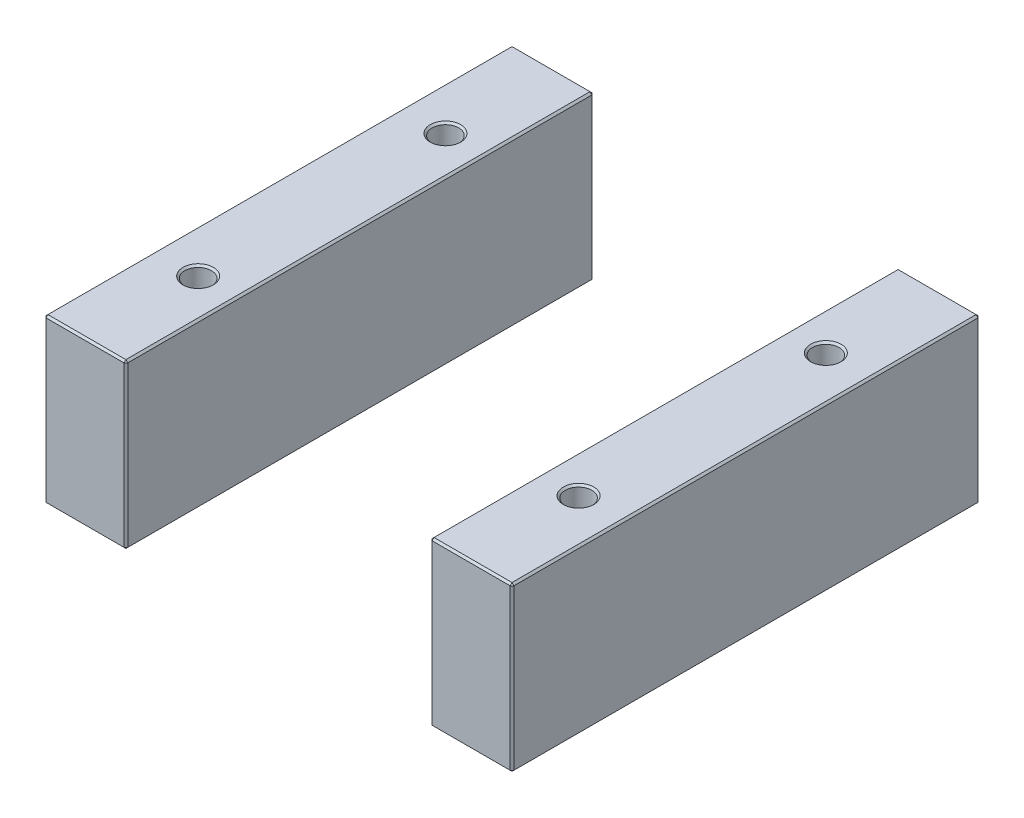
ISO-10303-21;
HEADER;
FILE_DESCRIPTION(('STEP AP214'),'2;1');
FILE_NAME('part.step','',(''),(''),'','','');
FILE_SCHEMA(('AUTOMOTIVE_DESIGN { 1 0 10303 214 1 1 1 1 }'));
ENDSEC;
DATA;
#1=APPLICATION_CONTEXT('core data for automotive mechanical design processes');
#2=APPLICATION_PROTOCOL_DEFINITION('international standard','automotive_design',2000,#1);
#3=PRODUCT_CONTEXT('',#1,'mechanical');
#4=PRODUCT('Part','Part','',(#3));
#5=PRODUCT_RELATED_PRODUCT_CATEGORY('part','',(#4));
#6=PRODUCT_DEFINITION_FORMATION('','',#4);
#7=PRODUCT_DEFINITION_CONTEXT('part definition',#1,'design');
#8=PRODUCT_DEFINITION('design','',#6,#7);
#9=PRODUCT_DEFINITION_SHAPE('','',#8);
#10=(LENGTH_UNIT() NAMED_UNIT(*) SI_UNIT(.MILLI.,.METRE.));
#11=(NAMED_UNIT(*) PLANE_ANGLE_UNIT() SI_UNIT($,.RADIAN.));
#12=(NAMED_UNIT(*) SI_UNIT($,.STERADIAN.) SOLID_ANGLE_UNIT());
#13=UNCERTAINTY_MEASURE_WITH_UNIT(LENGTH_MEASURE(1.E-05),#10,'distance_accuracy_value','');
#14=(GEOMETRIC_REPRESENTATION_CONTEXT(3) GLOBAL_UNCERTAINTY_ASSIGNED_CONTEXT((#13)) GLOBAL_UNIT_ASSIGNED_CONTEXT((#10,
#11,#12)) REPRESENTATION_CONTEXT('',''));
#15=CARTESIAN_POINT('',(0.,0.,0.));
#16=DIRECTION('',(0.,0.,1.));
#17=DIRECTION('',(1.,0.,0.));
#18=AXIS2_PLACEMENT_3D('',#15,#16,#17);
#19=CARTESIAN_POINT('',(-123.,86.,-123.));
#20=DIRECTION('',(0.,0.,1.));
#21=DIRECTION('',(1.,0.,0.));
#22=AXIS2_PLACEMENT_3D('',#19,#20,#21);
#23=PLANE('',#22);
#24=DIRECTION('',(-1.,0.,0.));
#25=VECTOR('',#24,1.);
#26=CARTESIAN_POINT('',(-123.,0.999999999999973,-123.));
#27=LINE('',#26,#25);
#28=CARTESIAN_POINT('',(-81.,0.999999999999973,-123.));
#29=VERTEX_POINT('',#28);
#30=CARTESIAN_POINT('',(-122.,0.999999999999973,-123.));
#31=VERTEX_POINT('',#30);
#32=EDGE_CURVE('P0_E137',#29,#31,#27,.T.);
#33=ORIENTED_EDGE('',*,*,#32,.T.);
#34=DIRECTION('',(0.,1.,0.));
#35=VECTOR('',#34,1.);
#36=CARTESIAN_POINT('',(-122.,86.,-123.));
#37=LINE('',#36,#35);
#38=CARTESIAN_POINT('',(-122.,85.,-123.));
#39=VERTEX_POINT('',#38);
#40=EDGE_CURVE('P0_E235',#31,#39,#37,.T.);
#41=ORIENTED_EDGE('',*,*,#40,.T.);
#42=DIRECTION('',(1.,0.,0.));
#43=VECTOR('',#42,1.);
#44=CARTESIAN_POINT('',(-123.,85.,-123.));
#45=LINE('',#44,#43);
#46=CARTESIAN_POINT('',(-81.,85.,-123.));
#47=VERTEX_POINT('',#46);
#48=EDGE_CURVE('P0_E233',#39,#47,#45,.T.);
#49=ORIENTED_EDGE('',*,*,#48,.T.);
#50=DIRECTION('',(0.,-1.,0.));
#51=VECTOR('',#50,1.);
#52=CARTESIAN_POINT('',(-81.,86.,-123.));
#53=LINE('',#52,#51);
#54=EDGE_CURVE('P0_E230',#47,#29,#53,.T.);
#55=ORIENTED_EDGE('',*,*,#54,.T.);
#56=EDGE_LOOP('',(#33,#41,#49,#55));
#57=FACE_BOUND('',#56,.T.);
#58=ADVANCED_FACE('P0_F16',(#57),#23,.F.);
#59=CARTESIAN_POINT('',(-123.,86.,123.));
#60=DIRECTION('',(1.,0.,0.));
#61=DIRECTION('',(0.,0.,-1.));
#62=AXIS2_PLACEMENT_3D('',#59,#60,#61);
#63=PLANE('',#62);
#64=DIRECTION('',(0.,1.,0.));
#65=VECTOR('',#64,1.);
#66=CARTESIAN_POINT('',(-123.,86.,122.));
#67=LINE('',#66,#65);
#68=CARTESIAN_POINT('',(-123.,0.999999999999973,122.));
#69=VERTEX_POINT('',#68);
#70=CARTESIAN_POINT('',(-123.,85.,122.));
#71=VERTEX_POINT('',#70);
#72=EDGE_CURVE('P0_E217',#69,#71,#67,.T.);
#73=ORIENTED_EDGE('',*,*,#72,.T.);
#74=DIRECTION('',(0.,0.,-1.));
#75=VECTOR('',#74,1.);
#76=CARTESIAN_POINT('',(-123.,85.,123.));
#77=LINE('',#76,#75);
#78=CARTESIAN_POINT('',(-123.,85.,-122.));
#79=VERTEX_POINT('',#78);
#80=EDGE_CURVE('P0_E228',#71,#79,#77,.T.);
#81=ORIENTED_EDGE('',*,*,#80,.T.);
#82=DIRECTION('',(0.,-1.,0.));
#83=VECTOR('',#82,1.);
#84=CARTESIAN_POINT('',(-123.,86.,-122.));
#85=LINE('',#84,#83);
#86=CARTESIAN_POINT('',(-123.,0.999999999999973,-122.));
#87=VERTEX_POINT('',#86);
#88=EDGE_CURVE('P0_E225',#79,#87,#85,.T.);
#89=ORIENTED_EDGE('',*,*,#88,.T.);
#90=DIRECTION('',(0.,0.,1.));
#91=VECTOR('',#90,1.);
#92=CARTESIAN_POINT('',(-123.,0.999999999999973,123.));
#93=LINE('',#92,#91);
#94=EDGE_CURVE('P0_E214',#87,#69,#93,.T.);
#95=ORIENTED_EDGE('',*,*,#94,.T.);
#96=EDGE_LOOP('',(#73,#81,#89,#95));
#97=FACE_BOUND('',#96,.T.);
#98=ADVANCED_FACE('P0_F302',(#97),#63,.F.);
#99=CARTESIAN_POINT('',(-123.,86.,123.));
#100=DIRECTION('',(0.,0.,-1.));
#101=DIRECTION('',(-1.,0.,0.));
#102=AXIS2_PLACEMENT_3D('',#99,#100,#101);
#103=PLANE('',#102);
#104=DIRECTION('',(-1.,0.,0.));
#105=VECTOR('',#104,1.);
#106=CARTESIAN_POINT('',(-123.,85.,123.));
#107=LINE('',#106,#105);
#108=CARTESIAN_POINT('',(-81.,85.,123.));
#109=VERTEX_POINT('',#108);
#110=CARTESIAN_POINT('',(-122.,85.,123.));
#111=VERTEX_POINT('',#110);
#112=EDGE_CURVE('P0_E242',#109,#111,#107,.T.);
#113=ORIENTED_EDGE('',*,*,#112,.T.);
#114=DIRECTION('',(0.,-1.,0.));
#115=VECTOR('',#114,1.);
#116=CARTESIAN_POINT('',(-122.,86.,123.));
#117=LINE('',#116,#115);
#118=CARTESIAN_POINT('',(-122.,0.999999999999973,123.));
#119=VERTEX_POINT('',#118);
#120=EDGE_CURVE('P0_E244',#111,#119,#117,.T.);
#121=ORIENTED_EDGE('',*,*,#120,.T.);
#122=DIRECTION('',(1.,0.,0.));
#123=VECTOR('',#122,1.);
#124=CARTESIAN_POINT('',(-80.,0.999999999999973,123.));
#125=LINE('',#124,#123);
#126=CARTESIAN_POINT('',(-81.,0.999999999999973,123.));
#127=VERTEX_POINT('',#126);
#128=EDGE_CURVE('P0_E240',#119,#127,#125,.T.);
#129=ORIENTED_EDGE('',*,*,#128,.T.);
#130=DIRECTION('',(0.,1.,0.));
#131=VECTOR('',#130,1.);
#132=CARTESIAN_POINT('',(-81.,86.,123.));
#133=LINE('',#132,#131);
#134=EDGE_CURVE('P0_E238',#127,#109,#133,.T.);
#135=ORIENTED_EDGE('',*,*,#134,.T.);
#136=EDGE_LOOP('',(#113,#121,#129,#135));
#137=FACE_BOUND('',#136,.T.);
#138=ADVANCED_FACE('P0_F341',(#137),#103,.F.);
#139=CARTESIAN_POINT('',(-80.,86.,-123.));
#140=DIRECTION('',(-1.,0.,0.));
#141=DIRECTION('',(0.,0.,1.));
#142=AXIS2_PLACEMENT_3D('',#139,#140,#141);
#143=PLANE('',#142);
#144=DIRECTION('',(0.,0.,1.));
#145=VECTOR('',#144,1.);
#146=CARTESIAN_POINT('',(-80.,85.,-123.));
#147=LINE('',#146,#145);
#148=CARTESIAN_POINT('',(-80.,85.,-122.));
#149=VERTEX_POINT('',#148);
#150=CARTESIAN_POINT('',(-80.,85.,122.));
#151=VERTEX_POINT('',#150);
#152=EDGE_CURVE('P0_E31',#149,#151,#147,.T.);
#153=ORIENTED_EDGE('',*,*,#152,.T.);
#154=DIRECTION('',(0.,-1.,0.));
#155=VECTOR('',#154,1.);
#156=CARTESIAN_POINT('',(-80.,86.,122.));
#157=LINE('',#156,#155);
#158=CARTESIAN_POINT('',(-80.,0.999999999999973,122.));
#159=VERTEX_POINT('',#158);
#160=EDGE_CURVE('P0_E190',#151,#159,#157,.T.);
#161=ORIENTED_EDGE('',*,*,#160,.T.);
#162=DIRECTION('',(0.,0.,-1.));
#163=VECTOR('',#162,1.);
#164=CARTESIAN_POINT('',(-80.,0.999999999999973,-123.));
#165=LINE('',#164,#163);
#166=CARTESIAN_POINT('',(-80.,0.999999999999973,-122.));
#167=VERTEX_POINT('',#166);
#168=EDGE_CURVE('P0_E256',#159,#167,#165,.T.);
#169=ORIENTED_EDGE('',*,*,#168,.T.);
#170=DIRECTION('',(0.,1.,0.));
#171=VECTOR('',#170,1.);
#172=CARTESIAN_POINT('',(-80.,86.,-122.));
#173=LINE('',#172,#171);
#174=EDGE_CURVE('P0_E36',#167,#149,#173,.T.);
#175=ORIENTED_EDGE('',*,*,#174,.T.);
#176=EDGE_LOOP('',(#153,#161,#169,#175));
#177=FACE_BOUND('',#176,.T.);
#178=ADVANCED_FACE('P0_F535',(#177),#143,.F.);
#179=CARTESIAN_POINT('',(0.,86.,0.));
#180=DIRECTION('',(0.,-1.,0.));
#181=DIRECTION('',(0.,0.,-1.));
#182=AXIS2_PLACEMENT_3D('',#179,#180,#181);
#183=PLANE('',#182);
#184=CARTESIAN_POINT('',(-100.,86.,65.));
#185=DIRECTION('',(0.,-1.,0.));
#186=DIRECTION('',(0.,0.,-1.));
#187=AXIS2_PLACEMENT_3D('',#184,#185,#186);
#188=CIRCLE('',#187,8.);
#189=CARTESIAN_POINT('',(-100.,86.,57.));
#190=VERTEX_POINT('',#189);
#191=EDGE_CURVE('P0_E24',#190,#190,#188,.T.);
#192=ORIENTED_EDGE('',*,*,#191,.T.);
#193=EDGE_LOOP('',(#192));
#194=FACE_BOUND('',#193,.T.);
#195=CARTESIAN_POINT('',(-100.,86.,-65.));
#196=DIRECTION('',(0.,-1.,0.));
#197=DIRECTION('',(0.,0.,-1.));
#198=AXIS2_PLACEMENT_3D('',#195,#196,#197);
#199=CIRCLE('',#198,8.);
#200=CARTESIAN_POINT('',(-100.,86.,-73.));
#201=VERTEX_POINT('',#200);
#202=EDGE_CURVE('P0_E189',#201,#201,#199,.T.);
#203=ORIENTED_EDGE('',*,*,#202,.T.);
#204=EDGE_LOOP('',(#203));
#205=FACE_BOUND('',#204,.T.);
#206=DIRECTION('',(0.,0.,1.));
#207=VECTOR('',#206,1.);
#208=CARTESIAN_POINT('',(-122.,86.,0.));
#209=LINE('',#208,#207);
#210=CARTESIAN_POINT('',(-122.,86.,-122.));
#211=VERTEX_POINT('',#210);
#212=CARTESIAN_POINT('',(-122.,86.,122.));
#213=VERTEX_POINT('',#212);
#214=EDGE_CURVE('P0_E251',#211,#213,#209,.T.);
#215=ORIENTED_EDGE('',*,*,#214,.T.);
#216=DIRECTION('',(1.,0.,0.));
#217=VECTOR('',#216,1.);
#218=CARTESIAN_POINT('',(0.,86.,122.));
#219=LINE('',#218,#217);
#220=CARTESIAN_POINT('',(-81.,86.,122.));
#221=VERTEX_POINT('',#220);
#222=EDGE_CURVE('P0_E253',#213,#221,#219,.T.);
#223=ORIENTED_EDGE('',*,*,#222,.T.);
#224=DIRECTION('',(0.,0.,-1.));
#225=VECTOR('',#224,1.);
#226=CARTESIAN_POINT('',(-81.,86.,0.));
#227=LINE('',#226,#225);
#228=CARTESIAN_POINT('',(-81.,86.,-122.));
#229=VERTEX_POINT('',#228);
#230=EDGE_CURVE('P0_E247',#221,#229,#227,.T.);
#231=ORIENTED_EDGE('',*,*,#230,.T.);
#232=DIRECTION('',(-1.,0.,0.));
#233=VECTOR('',#232,1.);
#234=CARTESIAN_POINT('',(0.,86.,-122.));
#235=LINE('',#234,#233);
#236=EDGE_CURVE('P0_E249',#229,#211,#235,.T.);
#237=ORIENTED_EDGE('',*,*,#236,.T.);
#238=EDGE_LOOP('',(#215,#223,#231,#237));
#239=FACE_BOUND('',#238,.T.);
#240=ADVANCED_FACE('P0_F195',(#194,#205,#239),#183,.F.);
#241=CARTESIAN_POINT('',(0.,0.,0.));
#242=DIRECTION('',(0.,-1.,0.));
#243=DIRECTION('',(0.,0.,-1.));
#244=AXIS2_PLACEMENT_3D('',#241,#242,#243);
#245=PLANE('',#244);
#246=CARTESIAN_POINT('',(-100.,0.,-65.));
#247=DIRECTION('',(0.,-1.,0.));
#248=DIRECTION('',(0.,0.,-1.));
#249=AXIS2_PLACEMENT_3D('',#246,#247,#248);
#250=CIRCLE('',#249,8.);
#251=CARTESIAN_POINT('',(-100.,0.,-73.));
#252=VERTEX_POINT('',#251);
#253=EDGE_CURVE('P0_E220',#252,#252,#250,.F.);
#254=ORIENTED_EDGE('',*,*,#253,.T.);
#255=EDGE_LOOP('',(#254));
#256=FACE_BOUND('',#255,.T.);
#257=CARTESIAN_POINT('',(-100.,0.,65.));
#258=DIRECTION('',(0.,-1.,0.));
#259=DIRECTION('',(0.,0.,-1.));
#260=AXIS2_PLACEMENT_3D('',#257,#258,#259);
#261=CIRCLE('',#260,8.);
#262=CARTESIAN_POINT('',(-100.,0.,57.));
#263=VERTEX_POINT('',#262);
#264=EDGE_CURVE('P0_E608',#263,#263,#261,.F.);
#265=ORIENTED_EDGE('',*,*,#264,.T.);
#266=EDGE_LOOP('',(#265));
#267=FACE_BOUND('',#266,.T.);
#268=DIRECTION('',(-1.,0.,0.));
#269=VECTOR('',#268,1.);
#270=CARTESIAN_POINT('',(-123.,0.,122.));
#271=LINE('',#270,#269);
#272=CARTESIAN_POINT('',(-81.,0.,122.));
#273=VERTEX_POINT('',#272);
#274=CARTESIAN_POINT('',(-122.,0.,122.));
#275=VERTEX_POINT('',#274);
#276=EDGE_CURVE('P0_E114',#273,#275,#271,.T.);
#277=ORIENTED_EDGE('',*,*,#276,.T.);
#278=DIRECTION('',(0.,0.,-1.));
#279=VECTOR('',#278,1.);
#280=CARTESIAN_POINT('',(-122.,0.,-123.));
#281=LINE('',#280,#279);
#282=CARTESIAN_POINT('',(-122.,0.,-122.));
#283=VERTEX_POINT('',#282);
#284=EDGE_CURVE('P0_E110',#275,#283,#281,.T.);
#285=ORIENTED_EDGE('',*,*,#284,.T.);
#286=DIRECTION('',(1.,0.,0.));
#287=VECTOR('',#286,1.);
#288=CARTESIAN_POINT('',(-80.,0.,-122.));
#289=LINE('',#288,#287);
#290=CARTESIAN_POINT('',(-81.,0.,-122.));
#291=VERTEX_POINT('',#290);
#292=EDGE_CURVE('P0_E104',#283,#291,#289,.T.);
#293=ORIENTED_EDGE('',*,*,#292,.T.);
#294=DIRECTION('',(0.,0.,1.));
#295=VECTOR('',#294,1.);
#296=CARTESIAN_POINT('',(-81.,0.,123.));
#297=LINE('',#296,#295);
#298=EDGE_CURVE('P0_E107',#291,#273,#297,.T.);
#299=ORIENTED_EDGE('',*,*,#298,.T.);
#300=EDGE_LOOP('',(#277,#285,#293,#299));
#301=FACE_BOUND('',#300,.T.);
#302=ADVANCED_FACE('P0_F106',(#256,#267,#301),#245,.T.);
#303=CARTESIAN_POINT('',(-100.,0.,-65.));
#304=DIRECTION('',(0.,1.,0.));
#305=DIRECTION('',(0.,0.,1.));
#306=AXIS2_PLACEMENT_3D('',#303,#304,#305);
#307=CYLINDRICAL_SURFACE('',#306,7.);
#308=CARTESIAN_POINT('',(-100.,85.,-65.));
#309=DIRECTION('',(0.,-1.,0.));
#310=DIRECTION('',(0.,0.,-1.));
#311=AXIS2_PLACEMENT_3D('',#308,#309,#310);
#312=CIRCLE('',#311,7.);
#313=CARTESIAN_POINT('',(-100.,85.,-72.));
#314=VERTEX_POINT('',#313);
#315=EDGE_CURVE('P0_E10',#314,#314,#312,.F.);
#316=ORIENTED_EDGE('',*,*,#315,.T.);
#317=EDGE_LOOP('',(#316));
#318=FACE_BOUND('',#317,.T.);
#319=CARTESIAN_POINT('',(-100.,0.999999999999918,-65.));
#320=DIRECTION('',(0.,-1.,0.));
#321=DIRECTION('',(0.,0.,-1.));
#322=AXIS2_PLACEMENT_3D('',#319,#320,#321);
#323=CIRCLE('',#322,7.);
#324=CARTESIAN_POINT('',(-100.,0.999999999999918,-72.));
#325=VERTEX_POINT('',#324);
#326=EDGE_CURVE('P0_E215',#325,#325,#323,.T.);
#327=ORIENTED_EDGE('',*,*,#326,.T.);
#328=EDGE_LOOP('',(#327));
#329=FACE_BOUND('',#328,.T.);
#330=ADVANCED_FACE('P0_F208',(#318,#329),#307,.F.);
#331=CARTESIAN_POINT('',(-100.,0.,65.));
#332=DIRECTION('',(0.,1.,0.));
#333=DIRECTION('',(0.,0.,1.));
#334=AXIS2_PLACEMENT_3D('',#331,#332,#333);
#335=CYLINDRICAL_SURFACE('',#334,7.);
#336=CARTESIAN_POINT('',(-100.,85.,65.));
#337=DIRECTION('',(0.,-1.,0.));
#338=DIRECTION('',(0.,0.,-1.));
#339=AXIS2_PLACEMENT_3D('',#336,#337,#338);
#340=CIRCLE('',#339,7.);
#341=CARTESIAN_POINT('',(-100.,85.,58.));
#342=VERTEX_POINT('',#341);
#343=EDGE_CURVE('P0_E186',#342,#342,#340,.F.);
#344=ORIENTED_EDGE('',*,*,#343,.T.);
#345=EDGE_LOOP('',(#344));
#346=FACE_BOUND('',#345,.T.);
#347=CARTESIAN_POINT('',(-100.,0.99999999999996,65.));
#348=DIRECTION('',(0.,-1.,0.));
#349=DIRECTION('',(0.,0.,-1.));
#350=AXIS2_PLACEMENT_3D('',#347,#348,#349);
#351=CIRCLE('',#350,7.);
#352=CARTESIAN_POINT('',(-100.,0.99999999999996,58.));
#353=VERTEX_POINT('',#352);
#354=EDGE_CURVE('P0_E212',#353,#353,#351,.T.);
#355=ORIENTED_EDGE('',*,*,#354,.T.);
#356=EDGE_LOOP('',(#355));
#357=FACE_BOUND('',#356,.T.);
#358=ADVANCED_FACE('P0_F204',(#346,#357),#335,.F.);
#359=CARTESIAN_POINT('',(-100.,0.,-65.));
#360=DIRECTION('',(0.,-1.,0.));
#361=DIRECTION('',(0.,0.,-1.));
#362=AXIS2_PLACEMENT_3D('',#359,#360,#361);
#363=CONICAL_SURFACE('',#362,8.,0.785398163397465);
#364=ORIENTED_EDGE('',*,*,#326,.F.);
#365=EDGE_LOOP('',(#364));
#366=FACE_BOUND('',#365,.T.);
#367=ORIENTED_EDGE('',*,*,#253,.F.);
#368=EDGE_LOOP('',(#367));
#369=FACE_BOUND('',#368,.T.);
#370=ADVANCED_FACE('P0_F207',(#366,#369),#363,.F.);
#371=CARTESIAN_POINT('',(-100.,0.,65.));
#372=DIRECTION('',(0.,-1.,0.));
#373=DIRECTION('',(0.,0.,-1.));
#374=AXIS2_PLACEMENT_3D('',#371,#372,#373);
#375=CONICAL_SURFACE('',#374,8.,0.785398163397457);
#376=ORIENTED_EDGE('',*,*,#354,.F.);
#377=EDGE_LOOP('',(#376));
#378=FACE_BOUND('',#377,.T.);
#379=ORIENTED_EDGE('',*,*,#264,.F.);
#380=EDGE_LOOP('',(#379));
#381=FACE_BOUND('',#380,.T.);
#382=ADVANCED_FACE('P0_F347',(#378,#381),#375,.F.);
#383=CARTESIAN_POINT('',(-80.,86.,122.));
#384=DIRECTION('',(-0.707106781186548,0.,-0.707106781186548));
#385=DIRECTION('',(0.,-1.,0.));
#386=AXIS2_PLACEMENT_3D('',#383,#384,#385);
#387=PLANE('',#386);
#388=DIRECTION('',(-0.707106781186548,0.,0.707106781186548));
#389=VECTOR('',#388,1.);
#390=CARTESIAN_POINT('',(-80.5,85.,122.5));
#391=LINE('',#390,#389);
#392=EDGE_CURVE('P0_E125',#109,#151,#391,.F.);
#393=ORIENTED_EDGE('',*,*,#392,.F.);
#394=ORIENTED_EDGE('',*,*,#134,.F.);
#395=DIRECTION('',(0.707106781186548,0.,-0.707106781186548));
#396=VECTOR('',#395,1.);
#397=CARTESIAN_POINT('',(-81.,0.999999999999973,123.));
#398=LINE('',#397,#396);
#399=EDGE_CURVE('P0_E181',#159,#127,#398,.F.);
#400=ORIENTED_EDGE('',*,*,#399,.F.);
#401=ORIENTED_EDGE('',*,*,#160,.F.);
#402=EDGE_LOOP('',(#393,#394,#400,#401));
#403=FACE_BOUND('',#402,.T.);
#404=ADVANCED_FACE('P0_F351',(#403),#387,.F.);
#405=CARTESIAN_POINT('',(-81.,86.,122.));
#406=DIRECTION('',(0.57735026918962,0.577350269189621,0.577350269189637));
#407=DIRECTION('',(0.,-0.707106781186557,0.707106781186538));
#408=AXIS2_PLACEMENT_3D('',#405,#406,#407);
#409=PLANE('',#408);
#410=DIRECTION('',(0.,0.707106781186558,-0.707106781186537));
#411=VECTOR('',#410,1.);
#412=CARTESIAN_POINT('',(-81.,86.,122.));
#413=LINE('',#412,#411);
#414=EDGE_CURVE('P0_E175',#109,#221,#413,.T.);
#415=ORIENTED_EDGE('',*,*,#414,.F.);
#416=ORIENTED_EDGE('',*,*,#392,.T.);
#417=DIRECTION('',(0.70710678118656,-0.707106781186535,0.));
#418=VECTOR('',#417,1.);
#419=CARTESIAN_POINT('',(-81.,86.,122.));
#420=LINE('',#419,#418);
#421=EDGE_CURVE('P0_E178',#221,#151,#420,.T.);
#422=ORIENTED_EDGE('',*,*,#421,.F.);
#423=EDGE_LOOP('',(#415,#416,#422));
#424=FACE_BOUND('',#423,.T.);
#425=ADVANCED_FACE('P0_F487',(#424),#409,.T.);
#426=CARTESIAN_POINT('',(-81.,0.999999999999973,123.));
#427=DIRECTION('',(0.577350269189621,-0.577350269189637,0.577350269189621));
#428=DIRECTION('',(0.,-0.707106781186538,-0.707106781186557));
#429=AXIS2_PLACEMENT_3D('',#426,#427,#428);
#430=PLANE('',#429);
#431=DIRECTION('',(0.70710678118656,0.707106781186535,0.));
#432=VECTOR('',#431,1.);
#433=CARTESIAN_POINT('',(-80.5,0.499999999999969,122.));
#434=LINE('',#433,#432);
#435=EDGE_CURVE('P0_E123',#159,#273,#434,.F.);
#436=ORIENTED_EDGE('',*,*,#435,.F.);
#437=ORIENTED_EDGE('',*,*,#399,.T.);
#438=DIRECTION('',(0.,-0.707106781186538,-0.707106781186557));
#439=VECTOR('',#438,1.);
#440=CARTESIAN_POINT('',(-81.,0.999999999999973,123.));
#441=LINE('',#440,#439);
#442=EDGE_CURVE('P0_E172',#273,#127,#441,.F.);
#443=ORIENTED_EDGE('',*,*,#442,.F.);
#444=EDGE_LOOP('',(#436,#437,#443));
#445=FACE_BOUND('',#444,.T.);
#446=ADVANCED_FACE('P0_F478',(#445),#430,.T.);
#447=CARTESIAN_POINT('',(-81.,86.,0.));
#448=DIRECTION('',(-0.707106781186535,-0.70710678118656,0.));
#449=DIRECTION('',(0.,0.,-1.));
#450=AXIS2_PLACEMENT_3D('',#447,#448,#449);
#451=PLANE('',#450);
#452=ORIENTED_EDGE('',*,*,#421,.T.);
#453=ORIENTED_EDGE('',*,*,#152,.F.);
#454=DIRECTION('',(-0.70710678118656,0.707106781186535,0.));
#455=VECTOR('',#454,1.);
#456=CARTESIAN_POINT('',(-80.5,85.5,-122.));
#457=LINE('',#456,#455);
#458=EDGE_CURVE('P0_E165',#229,#149,#457,.F.);
#459=ORIENTED_EDGE('',*,*,#458,.F.);
#460=ORIENTED_EDGE('',*,*,#230,.F.);
#461=EDGE_LOOP('',(#452,#453,#459,#460));
#462=FACE_BOUND('',#461,.T.);
#463=ADVANCED_FACE('P0_F318',(#462),#451,.F.);
#464=CARTESIAN_POINT('',(0.,86.,122.));
#465=DIRECTION('',(0.,-0.707106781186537,-0.707106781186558));
#466=DIRECTION('',(1.,0.,0.));
#467=AXIS2_PLACEMENT_3D('',#464,#465,#466);
#468=PLANE('',#467);
#469=ORIENTED_EDGE('',*,*,#414,.T.);
#470=ORIENTED_EDGE('',*,*,#222,.F.);
#471=DIRECTION('',(0.,-0.707106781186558,0.707106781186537));
#472=VECTOR('',#471,1.);
#473=CARTESIAN_POINT('',(-122.,85.5,122.5));
#474=LINE('',#473,#472);
#475=EDGE_CURVE('P0_E162',#111,#213,#474,.F.);
#476=ORIENTED_EDGE('',*,*,#475,.F.);
#477=ORIENTED_EDGE('',*,*,#112,.F.);
#478=EDGE_LOOP('',(#469,#470,#476,#477));
#479=FACE_BOUND('',#478,.T.);
#480=ADVANCED_FACE('P0_F313',(#479),#468,.F.);
#481=CARTESIAN_POINT('',(-122.,86.,123.));
#482=DIRECTION('',(0.707106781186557,0.,-0.707106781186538));
#483=DIRECTION('',(0.,-1.,0.));
#484=AXIS2_PLACEMENT_3D('',#481,#482,#483);
#485=PLANE('',#484);
#486=DIRECTION('',(0.707106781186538,0.,0.707106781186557));
#487=VECTOR('',#486,1.);
#488=CARTESIAN_POINT('',(-122.,0.999999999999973,123.));
#489=LINE('',#488,#487);
#490=EDGE_CURVE('P0_E156',#119,#69,#489,.F.);
#491=ORIENTED_EDGE('',*,*,#490,.F.);
#492=ORIENTED_EDGE('',*,*,#120,.F.);
#493=DIRECTION('',(-0.707106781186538,0.,-0.707106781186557));
#494=VECTOR('',#493,1.);
#495=CARTESIAN_POINT('',(-123.,85.,122.));
#496=LINE('',#495,#494);
#497=EDGE_CURVE('P0_E159',#71,#111,#496,.F.);
#498=ORIENTED_EDGE('',*,*,#497,.F.);
#499=ORIENTED_EDGE('',*,*,#72,.F.);
#500=EDGE_LOOP('',(#491,#492,#498,#499));
#501=FACE_BOUND('',#500,.T.);
#502=ADVANCED_FACE('P0_F307',(#501),#485,.F.);
#503=CARTESIAN_POINT('',(-123.,0.999999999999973,123.));
#504=DIRECTION('',(0.,-0.707106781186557,0.707106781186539));
#505=DIRECTION('',(-1.,0.,0.));
#506=AXIS2_PLACEMENT_3D('',#503,#504,#505);
#507=PLANE('',#506);
#508=ORIENTED_EDGE('',*,*,#442,.T.);
#509=ORIENTED_EDGE('',*,*,#128,.F.);
#510=DIRECTION('',(0.,0.707106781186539,0.707106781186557));
#511=VECTOR('',#510,1.);
#512=CARTESIAN_POINT('',(-122.,0.999999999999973,123.));
#513=LINE('',#512,#511);
#514=EDGE_CURVE('P0_E134',#275,#119,#513,.T.);
#515=ORIENTED_EDGE('',*,*,#514,.F.);
#516=ORIENTED_EDGE('',*,*,#276,.F.);
#517=EDGE_LOOP('',(#508,#509,#515,#516));
#518=FACE_BOUND('',#517,.T.);
#519=ADVANCED_FACE('P0_F333',(#518),#507,.T.);
#520=CARTESIAN_POINT('',(-80.,0.999999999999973,-123.));
#521=DIRECTION('',(0.707106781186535,-0.70710678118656,0.));
#522=DIRECTION('',(0.,0.,1.));
#523=AXIS2_PLACEMENT_3D('',#520,#521,#522);
#524=PLANE('',#523);
#525=ORIENTED_EDGE('',*,*,#435,.T.);
#526=ORIENTED_EDGE('',*,*,#298,.F.);
#527=DIRECTION('',(-0.70710678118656,-0.707106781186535,0.));
#528=VECTOR('',#527,1.);
#529=CARTESIAN_POINT('',(-81.,0.,-122.));
#530=LINE('',#529,#528);
#531=EDGE_CURVE('P0_E120',#167,#291,#530,.T.);
#532=ORIENTED_EDGE('',*,*,#531,.F.);
#533=ORIENTED_EDGE('',*,*,#168,.F.);
#534=EDGE_LOOP('',(#525,#526,#532,#533));
#535=FACE_BOUND('',#534,.T.);
#536=ADVANCED_FACE('P0_F119',(#535),#524,.T.);
#537=CARTESIAN_POINT('',(-81.,86.,-123.));
#538=DIRECTION('',(-0.707106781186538,0.,0.707106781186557));
#539=DIRECTION('',(0.,-1.,0.));
#540=AXIS2_PLACEMENT_3D('',#537,#538,#539);
#541=PLANE('',#540);
#542=DIRECTION('',(0.707106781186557,0.,0.707106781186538));
#543=VECTOR('',#542,1.);
#544=CARTESIAN_POINT('',(-81.,85.,-123.));
#545=LINE('',#544,#543);
#546=EDGE_CURVE('P0_E168',#149,#47,#545,.F.);
#547=ORIENTED_EDGE('',*,*,#546,.F.);
#548=ORIENTED_EDGE('',*,*,#174,.F.);
#549=DIRECTION('',(-0.707106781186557,0.,-0.707106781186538));
#550=VECTOR('',#549,1.);
#551=CARTESIAN_POINT('',(-80.5,0.999999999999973,-122.5));
#552=LINE('',#551,#550);
#553=EDGE_CURVE('P0_E133',#29,#167,#552,.F.);
#554=ORIENTED_EDGE('',*,*,#553,.F.);
#555=ORIENTED_EDGE('',*,*,#54,.F.);
#556=EDGE_LOOP('',(#547,#548,#554,#555));
#557=FACE_BOUND('',#556,.T.);
#558=ADVANCED_FACE('P0_F323',(#557),#541,.F.);
#559=CARTESIAN_POINT('',(-81.,85.,-123.));
#560=DIRECTION('',(0.57735026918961,0.577350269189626,-0.577350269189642));
#561=DIRECTION('',(0.,0.707106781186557,0.707106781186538));
#562=AXIS2_PLACEMENT_3D('',#559,#560,#561);
#563=PLANE('',#562);
#564=ORIENTED_EDGE('',*,*,#458,.T.);
#565=ORIENTED_EDGE('',*,*,#546,.T.);
#566=DIRECTION('',(0.,-0.707106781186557,-0.707106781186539));
#567=VECTOR('',#566,1.);
#568=CARTESIAN_POINT('',(-81.,85.,-123.));
#569=LINE('',#568,#567);
#570=EDGE_CURVE('P0_E151',#229,#47,#569,.T.);
#571=ORIENTED_EDGE('',*,*,#570,.F.);
#572=EDGE_LOOP('',(#564,#565,#571));
#573=FACE_BOUND('',#572,.T.);
#574=ADVANCED_FACE('P0_F321',(#573),#563,.T.);
#575=CARTESIAN_POINT('',(-123.,85.,122.));
#576=DIRECTION('',(-0.577350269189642,0.57735026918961,0.577350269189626));
#577=DIRECTION('',(0.707106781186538,0.,0.707106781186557));
#578=AXIS2_PLACEMENT_3D('',#575,#576,#577);
#579=PLANE('',#578);
#580=ORIENTED_EDGE('',*,*,#497,.T.);
#581=ORIENTED_EDGE('',*,*,#475,.T.);
#582=DIRECTION('',(0.707106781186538,0.707106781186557,0.));
#583=VECTOR('',#582,1.);
#584=CARTESIAN_POINT('',(-123.,85.,122.));
#585=LINE('',#584,#583);
#586=EDGE_CURVE('P0_E142',#71,#213,#585,.T.);
#587=ORIENTED_EDGE('',*,*,#586,.F.);
#588=EDGE_LOOP('',(#580,#581,#587));
#589=FACE_BOUND('',#588,.T.);
#590=ADVANCED_FACE('P0_F310',(#589),#579,.T.);
#591=CARTESIAN_POINT('',(-122.,0.999999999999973,123.));
#592=DIRECTION('',(-0.577350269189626,-0.577350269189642,0.57735026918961));
#593=DIRECTION('',(0.707106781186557,-0.707106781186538,0.));
#594=AXIS2_PLACEMENT_3D('',#591,#592,#593);
#595=PLANE('',#594);
#596=ORIENTED_EDGE('',*,*,#514,.T.);
#597=ORIENTED_EDGE('',*,*,#490,.T.);
#598=DIRECTION('',(0.707106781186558,-0.707106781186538,0.));
#599=VECTOR('',#598,1.);
#600=CARTESIAN_POINT('',(-122.5,0.499999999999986,122.));
#601=LINE('',#600,#599);
#602=EDGE_CURVE('P0_E138',#275,#69,#601,.F.);
#603=ORIENTED_EDGE('',*,*,#602,.F.);
#604=EDGE_LOOP('',(#596,#597,#603));
#605=FACE_BOUND('',#604,.T.);
#606=ADVANCED_FACE('P0_F368',(#605),#595,.T.);
#607=CARTESIAN_POINT('',(-81.,0.,-122.));
#608=DIRECTION('',(0.57735026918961,-0.577350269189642,-0.577350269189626));
#609=DIRECTION('',(0.,0.707106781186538,-0.707106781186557));
#610=AXIS2_PLACEMENT_3D('',#607,#608,#609);
#611=PLANE('',#610);
#612=ORIENTED_EDGE('',*,*,#553,.T.);
#613=ORIENTED_EDGE('',*,*,#531,.T.);
#614=DIRECTION('',(0.,0.707106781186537,-0.707106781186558));
#615=VECTOR('',#614,1.);
#616=CARTESIAN_POINT('',(-81.,0.,-122.));
#617=LINE('',#616,#615);
#618=EDGE_CURVE('P0_E130',#29,#291,#617,.F.);
#619=ORIENTED_EDGE('',*,*,#618,.F.);
#620=EDGE_LOOP('',(#612,#613,#619));
#621=FACE_BOUND('',#620,.T.);
#622=ADVANCED_FACE('P0_F129',(#621),#611,.T.);
#623=CARTESIAN_POINT('',(0.,86.,-122.));
#624=DIRECTION('',(0.,-0.707106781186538,0.707106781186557));
#625=DIRECTION('',(-1.,0.,0.));
#626=AXIS2_PLACEMENT_3D('',#623,#624,#625);
#627=PLANE('',#626);
#628=ORIENTED_EDGE('',*,*,#570,.T.);
#629=ORIENTED_EDGE('',*,*,#48,.F.);
#630=DIRECTION('',(0.,0.707106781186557,0.707106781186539));
#631=VECTOR('',#630,1.);
#632=CARTESIAN_POINT('',(-122.,85.,-123.));
#633=LINE('',#632,#631);
#634=EDGE_CURVE('P0_E139',#211,#39,#633,.F.);
#635=ORIENTED_EDGE('',*,*,#634,.F.);
#636=ORIENTED_EDGE('',*,*,#236,.F.);
#637=EDGE_LOOP('',(#628,#629,#635,#636));
#638=FACE_BOUND('',#637,.T.);
#639=ADVANCED_FACE('P0_F286',(#638),#627,.F.);
#640=CARTESIAN_POINT('',(-122.,86.,0.));
#641=DIRECTION('',(0.707106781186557,-0.707106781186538,0.));
#642=DIRECTION('',(0.,0.,1.));
#643=AXIS2_PLACEMENT_3D('',#640,#641,#642);
#644=PLANE('',#643);
#645=ORIENTED_EDGE('',*,*,#586,.T.);
#646=ORIENTED_EDGE('',*,*,#214,.F.);
#647=DIRECTION('',(-0.707106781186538,-0.707106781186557,0.));
#648=VECTOR('',#647,1.);
#649=CARTESIAN_POINT('',(-122.5,85.5,-122.));
#650=LINE('',#649,#648);
#651=EDGE_CURVE('P0_E145',#79,#211,#650,.F.);
#652=ORIENTED_EDGE('',*,*,#651,.F.);
#653=ORIENTED_EDGE('',*,*,#80,.F.);
#654=EDGE_LOOP('',(#645,#646,#652,#653));
#655=FACE_BOUND('',#654,.T.);
#656=ADVANCED_FACE('P0_F280',(#655),#644,.F.);
#657=CARTESIAN_POINT('',(-123.,0.999999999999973,123.));
#658=DIRECTION('',(-0.707106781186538,-0.707106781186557,0.));
#659=DIRECTION('',(0.,0.,-1.));
#660=AXIS2_PLACEMENT_3D('',#657,#658,#659);
#661=PLANE('',#660);
#662=ORIENTED_EDGE('',*,*,#602,.T.);
#663=ORIENTED_EDGE('',*,*,#94,.F.);
#664=DIRECTION('',(-0.707106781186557,0.707106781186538,0.));
#665=VECTOR('',#664,1.);
#666=CARTESIAN_POINT('',(-123.,0.999999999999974,-122.));
#667=LINE('',#666,#665);
#668=EDGE_CURVE('P0_E267',#283,#87,#667,.T.);
#669=ORIENTED_EDGE('',*,*,#668,.F.);
#670=ORIENTED_EDGE('',*,*,#284,.F.);
#671=EDGE_LOOP('',(#662,#663,#669,#670));
#672=FACE_BOUND('',#671,.T.);
#673=ADVANCED_FACE('P0_F298',(#672),#661,.T.);
#674=CARTESIAN_POINT('',(-123.,0.999999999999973,-123.));
#675=DIRECTION('',(0.,-0.707106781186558,-0.707106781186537));
#676=DIRECTION('',(1.,0.,0.));
#677=AXIS2_PLACEMENT_3D('',#674,#675,#676);
#678=PLANE('',#677);
#679=ORIENTED_EDGE('',*,*,#618,.T.);
#680=ORIENTED_EDGE('',*,*,#292,.F.);
#681=DIRECTION('',(0.,-0.707106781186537,0.707106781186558));
#682=VECTOR('',#681,1.);
#683=CARTESIAN_POINT('',(-122.,0.499999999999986,-122.5));
#684=LINE('',#683,#682);
#685=EDGE_CURVE('P0_E265',#31,#283,#684,.T.);
#686=ORIENTED_EDGE('',*,*,#685,.F.);
#687=ORIENTED_EDGE('',*,*,#32,.F.);
#688=EDGE_LOOP('',(#679,#680,#686,#687));
#689=FACE_BOUND('',#688,.T.);
#690=ADVANCED_FACE('P0_F136',(#689),#678,.T.);
#691=CARTESIAN_POINT('',(-122.,85.,-123.));
#692=DIRECTION('',(-0.577350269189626,0.57735026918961,-0.577350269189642));
#693=DIRECTION('',(-0.707106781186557,0.,0.707106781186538));
#694=AXIS2_PLACEMENT_3D('',#691,#692,#693);
#695=PLANE('',#694);
#696=ORIENTED_EDGE('',*,*,#651,.T.);
#697=ORIENTED_EDGE('',*,*,#634,.T.);
#698=DIRECTION('',(0.707106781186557,0.,-0.707106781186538));
#699=VECTOR('',#698,1.);
#700=CARTESIAN_POINT('',(-122.,85.,-123.));
#701=LINE('',#700,#699);
#702=EDGE_CURVE('P0_E263',#79,#39,#701,.T.);
#703=ORIENTED_EDGE('',*,*,#702,.F.);
#704=EDGE_LOOP('',(#696,#697,#703));
#705=FACE_BOUND('',#704,.T.);
#706=ADVANCED_FACE('P0_F273',(#705),#695,.T.);
#707=CARTESIAN_POINT('',(-123.,0.999999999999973,-122.));
#708=DIRECTION('',(-0.57735026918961,-0.577350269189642,-0.577350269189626));
#709=DIRECTION('',(0.,0.707106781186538,-0.707106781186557));
#710=AXIS2_PLACEMENT_3D('',#707,#708,#709);
#711=PLANE('',#710);
#712=ORIENTED_EDGE('',*,*,#685,.T.);
#713=ORIENTED_EDGE('',*,*,#668,.T.);
#714=DIRECTION('',(-0.707106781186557,0.,0.707106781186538));
#715=VECTOR('',#714,1.);
#716=CARTESIAN_POINT('',(-123.,0.999999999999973,-122.));
#717=LINE('',#716,#715);
#718=EDGE_CURVE('P0_E261',#31,#87,#717,.T.);
#719=ORIENTED_EDGE('',*,*,#718,.F.);
#720=EDGE_LOOP('',(#712,#713,#719));
#721=FACE_BOUND('',#720,.T.);
#722=ADVANCED_FACE('P0_F294',(#721),#711,.T.);
#723=CARTESIAN_POINT('',(-123.,86.,-122.));
#724=DIRECTION('',(0.707106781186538,0.,0.707106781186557));
#725=DIRECTION('',(0.,-1.,0.));
#726=AXIS2_PLACEMENT_3D('',#723,#724,#725);
#727=PLANE('',#726);
#728=ORIENTED_EDGE('',*,*,#702,.T.);
#729=ORIENTED_EDGE('',*,*,#40,.F.);
#730=ORIENTED_EDGE('',*,*,#718,.T.);
#731=ORIENTED_EDGE('',*,*,#88,.F.);
#732=EDGE_LOOP('',(#728,#729,#730,#731));
#733=FACE_BOUND('',#732,.T.);
#734=ADVANCED_FACE('P0_F201',(#733),#727,.F.);
#735=CARTESIAN_POINT('',(-100.,85.,65.));
#736=DIRECTION('',(0.,1.,0.));
#737=DIRECTION('',(0.,0.,1.));
#738=AXIS2_PLACEMENT_3D('',#735,#736,#737);
#739=CONICAL_SURFACE('',#738,7.,0.785398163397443);
#740=ORIENTED_EDGE('',*,*,#191,.F.);
#741=EDGE_LOOP('',(#740));
#742=FACE_BOUND('',#741,.T.);
#743=ORIENTED_EDGE('',*,*,#343,.F.);
#744=EDGE_LOOP('',(#743));
#745=FACE_BOUND('',#744,.T.);
#746=ADVANCED_FACE('P0_F198',(#742,#745),#739,.F.);
#747=CARTESIAN_POINT('',(-100.,85.,-65.));
#748=DIRECTION('',(0.,1.,0.));
#749=DIRECTION('',(0.,0.,1.));
#750=AXIS2_PLACEMENT_3D('',#747,#748,#749);
#751=CONICAL_SURFACE('',#750,7.,0.785398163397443);
#752=ORIENTED_EDGE('',*,*,#202,.F.);
#753=EDGE_LOOP('',(#752));
#754=FACE_BOUND('',#753,.T.);
#755=ORIENTED_EDGE('',*,*,#315,.F.);
#756=EDGE_LOOP('',(#755));
#757=FACE_BOUND('',#756,.T.);
#758=ADVANCED_FACE('P0_F18',(#754,#757),#751,.F.);
#759=CLOSED_SHELL('',(#58,#98,#138,#178,#240,#302,#330,#358,#370,#382,#404,#425,#446,#463,#480,
#502,#519,#536,#558,#574,#590,#606,#622,#639,#656,#673,#690,#706,#722,#734,#746,#758));
#760=MANIFOLD_SOLID_BREP('P0_B1',#759);
#761=CARTESIAN_POINT('',(123.,86.,123.));
#762=DIRECTION('',(0.,0.,-1.));
#763=DIRECTION('',(-1.,0.,0.));
#764=AXIS2_PLACEMENT_3D('',#761,#762,#763);
#765=PLANE('',#764);
#766=DIRECTION('',(0.,-1.,0.));
#767=VECTOR('',#766,1.);
#768=CARTESIAN_POINT('',(81.,86.,123.));
#769=LINE('',#768,#767);
#770=CARTESIAN_POINT('',(81.,85.,123.));
#771=VERTEX_POINT('',#770);
#772=CARTESIAN_POINT('',(81.,1.,123.));
#773=VERTEX_POINT('',#772);
#774=EDGE_CURVE('P1_E174',#771,#773,#769,.T.);
#775=ORIENTED_EDGE('',*,*,#774,.T.);
#776=DIRECTION('',(1.,0.,0.));
#777=VECTOR('',#776,1.);
#778=CARTESIAN_POINT('',(123.,1.,123.));
#779=LINE('',#778,#777);
#780=CARTESIAN_POINT('',(122.,1.,123.));
#781=VERTEX_POINT('',#780);
#782=EDGE_CURVE('P1_E176',#773,#781,#779,.T.);
#783=ORIENTED_EDGE('',*,*,#782,.T.);
#784=DIRECTION('',(0.,1.,0.));
#785=VECTOR('',#784,1.);
#786=CARTESIAN_POINT('',(122.,86.,123.));
#787=LINE('',#786,#785);
#788=CARTESIAN_POINT('',(122.,85.,123.));
#789=VERTEX_POINT('',#788);
#790=EDGE_CURVE('P1_E172',#781,#789,#787,.T.);
#791=ORIENTED_EDGE('',*,*,#790,.T.);
#792=DIRECTION('',(-1.,0.,0.));
#793=VECTOR('',#792,1.);
#794=CARTESIAN_POINT('',(80.,85.,123.));
#795=LINE('',#794,#793);
#796=EDGE_CURVE('P1_E170',#789,#771,#795,.T.);
#797=ORIENTED_EDGE('',*,*,#796,.T.);
#798=EDGE_LOOP('',(#775,#783,#791,#797));
#799=FACE_BOUND('',#798,.T.);
#800=ADVANCED_FACE('P1_F17',(#799),#765,.F.);
#801=CARTESIAN_POINT('',(123.,86.,123.));
#802=DIRECTION('',(-1.,0.,0.));
#803=DIRECTION('',(0.,0.,1.));
#804=AXIS2_PLACEMENT_3D('',#801,#802,#803);
#805=PLANE('',#804);
#806=DIRECTION('',(0.,0.,1.));
#807=VECTOR('',#806,1.);
#808=CARTESIAN_POINT('',(123.,85.,123.));
#809=LINE('',#808,#807);
#810=CARTESIAN_POINT('',(123.,85.,-122.));
#811=VERTEX_POINT('',#810);
#812=CARTESIAN_POINT('',(123.,85.,122.));
#813=VERTEX_POINT('',#812);
#814=EDGE_CURVE('P1_E188',#811,#813,#809,.T.);
#815=ORIENTED_EDGE('',*,*,#814,.T.);
#816=DIRECTION('',(0.,-1.,0.));
#817=VECTOR('',#816,1.);
#818=CARTESIAN_POINT('',(123.,86.,122.));
#819=LINE('',#818,#817);
#820=CARTESIAN_POINT('',(123.,1.,122.));
#821=VERTEX_POINT('',#820);
#822=EDGE_CURVE('P1_E194',#813,#821,#819,.T.);
#823=ORIENTED_EDGE('',*,*,#822,.T.);
#824=DIRECTION('',(0.,0.,-1.));
#825=VECTOR('',#824,1.);
#826=CARTESIAN_POINT('',(123.,1.,123.));
#827=LINE('',#826,#825);
#828=CARTESIAN_POINT('',(123.,1.,-122.));
#829=VERTEX_POINT('',#828);
#830=EDGE_CURVE('P1_E192',#821,#829,#827,.T.);
#831=ORIENTED_EDGE('',*,*,#830,.T.);
#832=DIRECTION('',(0.,1.,0.));
#833=VECTOR('',#832,1.);
#834=CARTESIAN_POINT('',(123.,86.,-122.));
#835=LINE('',#834,#833);
#836=EDGE_CURVE('P1_E190',#829,#811,#835,.T.);
#837=ORIENTED_EDGE('',*,*,#836,.T.);
#838=EDGE_LOOP('',(#815,#823,#831,#837));
#839=FACE_BOUND('',#838,.T.);
#840=ADVANCED_FACE('P1_F276',(#839),#805,.F.);
#841=CARTESIAN_POINT('',(123.,86.,-123.));
#842=DIRECTION('',(0.,0.,1.));
#843=DIRECTION('',(1.,0.,0.));
#844=AXIS2_PLACEMENT_3D('',#841,#842,#843);
#845=PLANE('',#844);
#846=DIRECTION('',(0.,-1.,0.));
#847=VECTOR('',#846,1.);
#848=CARTESIAN_POINT('',(122.,86.,-123.));
#849=LINE('',#848,#847);
#850=CARTESIAN_POINT('',(122.,85.,-123.));
#851=VERTEX_POINT('',#850);
#852=CARTESIAN_POINT('',(122.,1.,-123.));
#853=VERTEX_POINT('',#852);
#854=EDGE_CURVE('P1_E165',#851,#853,#849,.T.);
#855=ORIENTED_EDGE('',*,*,#854,.T.);
#856=DIRECTION('',(-1.,0.,0.));
#857=VECTOR('',#856,1.);
#858=CARTESIAN_POINT('',(123.,1.,-123.));
#859=LINE('',#858,#857);
#860=CARTESIAN_POINT('',(81.,1.,-123.));
#861=VERTEX_POINT('',#860);
#862=EDGE_CURVE('P1_E113',#853,#861,#859,.T.);
#863=ORIENTED_EDGE('',*,*,#862,.T.);
#864=DIRECTION('',(0.,1.,0.));
#865=VECTOR('',#864,1.);
#866=CARTESIAN_POINT('',(81.,86.,-123.));
#867=LINE('',#866,#865);
#868=CARTESIAN_POINT('',(81.,85.,-123.));
#869=VERTEX_POINT('',#868);
#870=EDGE_CURVE('P1_E167',#861,#869,#867,.T.);
#871=ORIENTED_EDGE('',*,*,#870,.T.);
#872=DIRECTION('',(1.,0.,0.));
#873=VECTOR('',#872,1.);
#874=CARTESIAN_POINT('',(123.,85.,-123.));
#875=LINE('',#874,#873);
#876=EDGE_CURVE('P1_E163',#869,#851,#875,.T.);
#877=ORIENTED_EDGE('',*,*,#876,.T.);
#878=EDGE_LOOP('',(#855,#863,#871,#877));
#879=FACE_BOUND('',#878,.T.);
#880=ADVANCED_FACE('P1_F333',(#879),#845,.F.);
#881=CARTESIAN_POINT('',(80.,86.,-123.));
#882=DIRECTION('',(1.,0.,0.));
#883=DIRECTION('',(0.,0.,-1.));
#884=AXIS2_PLACEMENT_3D('',#881,#882,#883);
#885=PLANE('',#884);
#886=DIRECTION('',(0.,0.,-1.));
#887=VECTOR('',#886,1.);
#888=CARTESIAN_POINT('',(80.,85.,-123.));
#889=LINE('',#888,#887);
#890=CARTESIAN_POINT('',(80.,85.,122.));
#891=VERTEX_POINT('',#890);
#892=CARTESIAN_POINT('',(80.,85.,-122.));
#893=VERTEX_POINT('',#892);
#894=EDGE_CURVE('P1_E179',#891,#893,#889,.T.);
#895=ORIENTED_EDGE('',*,*,#894,.T.);
#896=DIRECTION('',(0.,-1.,0.));
#897=VECTOR('',#896,1.);
#898=CARTESIAN_POINT('',(80.,86.,-122.));
#899=LINE('',#898,#897);
#900=CARTESIAN_POINT('',(80.,1.,-122.));
#901=VERTEX_POINT('',#900);
#902=EDGE_CURVE('P1_E185',#893,#901,#899,.T.);
#903=ORIENTED_EDGE('',*,*,#902,.T.);
#904=DIRECTION('',(0.,0.,1.));
#905=VECTOR('',#904,1.);
#906=CARTESIAN_POINT('',(80.,1.,-123.));
#907=LINE('',#906,#905);
#908=CARTESIAN_POINT('',(80.,1.,122.));
#909=VERTEX_POINT('',#908);
#910=EDGE_CURVE('P1_E183',#901,#909,#907,.T.);
#911=ORIENTED_EDGE('',*,*,#910,.T.);
#912=DIRECTION('',(0.,1.,0.));
#913=VECTOR('',#912,1.);
#914=CARTESIAN_POINT('',(80.,86.,122.));
#915=LINE('',#914,#913);
#916=EDGE_CURVE('P1_E181',#909,#891,#915,.T.);
#917=ORIENTED_EDGE('',*,*,#916,.T.);
#918=EDGE_LOOP('',(#895,#903,#911,#917));
#919=FACE_BOUND('',#918,.T.);
#920=ADVANCED_FACE('P1_F544',(#919),#885,.F.);
#921=CARTESIAN_POINT('',(0.,86.,0.));
#922=DIRECTION('',(0.,1.,0.));
#923=DIRECTION('',(0.,0.,1.));
#924=AXIS2_PLACEMENT_3D('',#921,#922,#923);
#925=PLANE('',#924);
#926=DIRECTION('',(-1.,0.,0.));
#927=VECTOR('',#926,1.);
#928=CARTESIAN_POINT('',(80.,86.,-122.));
#929=LINE('',#928,#927);
#930=CARTESIAN_POINT('',(122.,86.,-122.));
#931=VERTEX_POINT('',#930);
#932=CARTESIAN_POINT('',(81.,86.,-122.));
#933=VERTEX_POINT('',#932);
#934=EDGE_CURVE('P1_E26',#931,#933,#929,.T.);
#935=ORIENTED_EDGE('',*,*,#934,.T.);
#936=DIRECTION('',(0.,0.,1.));
#937=VECTOR('',#936,1.);
#938=CARTESIAN_POINT('',(81.,86.,123.));
#939=LINE('',#938,#937);
#940=CARTESIAN_POINT('',(81.,86.,122.));
#941=VERTEX_POINT('',#940);
#942=EDGE_CURVE('P1_E11',#933,#941,#939,.T.);
#943=ORIENTED_EDGE('',*,*,#942,.T.);
#944=DIRECTION('',(1.,0.,0.));
#945=VECTOR('',#944,1.);
#946=CARTESIAN_POINT('',(123.,86.,122.));
#947=LINE('',#946,#945);
#948=CARTESIAN_POINT('',(122.,86.,122.));
#949=VERTEX_POINT('',#948);
#950=EDGE_CURVE('P1_E203',#941,#949,#947,.T.);
#951=ORIENTED_EDGE('',*,*,#950,.T.);
#952=DIRECTION('',(0.,0.,-1.));
#953=VECTOR('',#952,1.);
#954=CARTESIAN_POINT('',(122.,86.,-123.));
#955=LINE('',#954,#953);
#956=EDGE_CURVE('P1_E37',#949,#931,#955,.T.);
#957=ORIENTED_EDGE('',*,*,#956,.T.);
#958=EDGE_LOOP('',(#935,#943,#951,#957));
#959=FACE_BOUND('',#958,.T.);
#960=CARTESIAN_POINT('',(100.,86.,-65.));
#961=DIRECTION('',(0.,1.,0.));
#962=DIRECTION('',(0.,0.,1.));
#963=AXIS2_PLACEMENT_3D('',#960,#961,#962);
#964=CIRCLE('',#963,8.);
#965=CARTESIAN_POINT('',(100.,86.,-57.));
#966=VERTEX_POINT('',#965);
#967=EDGE_CURVE('P1_E200',#966,#966,#964,.F.);
#968=ORIENTED_EDGE('',*,*,#967,.T.);
#969=EDGE_LOOP('',(#968));
#970=FACE_BOUND('',#969,.T.);
#971=CARTESIAN_POINT('',(100.,86.,65.));
#972=DIRECTION('',(0.,1.,0.));
#973=DIRECTION('',(0.,0.,1.));
#974=AXIS2_PLACEMENT_3D('',#971,#972,#973);
#975=CIRCLE('',#974,8.);
#976=CARTESIAN_POINT('',(100.,86.,73.));
#977=VERTEX_POINT('',#976);
#978=EDGE_CURVE('P1_E197',#977,#977,#975,.F.);
#979=ORIENTED_EDGE('',*,*,#978,.T.);
#980=EDGE_LOOP('',(#979));
#981=FACE_BOUND('',#980,.T.);
#982=ADVANCED_FACE('P1_F299',(#959,#970,#981),#925,.T.);
#983=CARTESIAN_POINT('',(0.,0.,0.));
#984=DIRECTION('',(0.,1.,0.));
#985=DIRECTION('',(0.,0.,1.));
#986=AXIS2_PLACEMENT_3D('',#983,#984,#985);
#987=PLANE('',#986);
#988=CARTESIAN_POINT('',(100.,0.,-65.));
#989=DIRECTION('',(0.,1.,0.));
#990=DIRECTION('',(0.,0.,1.));
#991=AXIS2_PLACEMENT_3D('',#988,#989,#990);
#992=CIRCLE('',#991,8.);
#993=CARTESIAN_POINT('',(100.,0.,-57.));
#994=VERTEX_POINT('',#993);
#995=EDGE_CURVE('P1_E148',#994,#994,#992,.T.);
#996=ORIENTED_EDGE('',*,*,#995,.T.);
#997=EDGE_LOOP('',(#996));
#998=FACE_BOUND('',#997,.T.);
#999=CARTESIAN_POINT('',(100.,0.,65.));
#1000=DIRECTION('',(0.,1.,0.));
#1001=DIRECTION('',(0.,0.,1.));
#1002=AXIS2_PLACEMENT_3D('',#999,#1000,#1001);
#1003=CIRCLE('',#1002,8.);
#1004=CARTESIAN_POINT('',(100.,0.,73.));
#1005=VERTEX_POINT('',#1004);
#1006=EDGE_CURVE('P1_E142',#1005,#1005,#1003,.T.);
#1007=ORIENTED_EDGE('',*,*,#1006,.T.);
#1008=EDGE_LOOP('',(#1007));
#1009=FACE_BOUND('',#1008,.T.);
#1010=DIRECTION('',(-1.,0.,0.));
#1011=VECTOR('',#1010,1.);
#1012=CARTESIAN_POINT('',(0.,0.,122.));
#1013=LINE('',#1012,#1011);
#1014=CARTESIAN_POINT('',(122.,0.,122.));
#1015=VERTEX_POINT('',#1014);
#1016=CARTESIAN_POINT('',(81.,0.,122.));
#1017=VERTEX_POINT('',#1016);
#1018=EDGE_CURVE('P1_E135',#1015,#1017,#1013,.T.);
#1019=ORIENTED_EDGE('',*,*,#1018,.T.);
#1020=DIRECTION('',(0.,0.,-1.));
#1021=VECTOR('',#1020,1.);
#1022=CARTESIAN_POINT('',(81.,0.,0.));
#1023=LINE('',#1022,#1021);
#1024=CARTESIAN_POINT('',(81.,0.,-122.));
#1025=VERTEX_POINT('',#1024);
#1026=EDGE_CURVE('P1_E139',#1017,#1025,#1023,.T.);
#1027=ORIENTED_EDGE('',*,*,#1026,.T.);
#1028=DIRECTION('',(1.,0.,0.));
#1029=VECTOR('',#1028,1.);
#1030=CARTESIAN_POINT('',(-6.29987018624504E-13,0.,-121.999999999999));
#1031=LINE('',#1030,#1029);
#1032=CARTESIAN_POINT('',(122.,0.,-122.));
#1033=VERTEX_POINT('',#1032);
#1034=EDGE_CURVE('P1_E110',#1025,#1033,#1031,.T.);
#1035=ORIENTED_EDGE('',*,*,#1034,.T.);
#1036=DIRECTION('',(0.,0.,1.));
#1037=VECTOR('',#1036,1.);
#1038=CARTESIAN_POINT('',(122.,0.,0.));
#1039=LINE('',#1038,#1037);
#1040=EDGE_CURVE('P1_E129',#1033,#1015,#1039,.T.);
#1041=ORIENTED_EDGE('',*,*,#1040,.T.);
#1042=EDGE_LOOP('',(#1019,#1027,#1035,#1041));
#1043=FACE_BOUND('',#1042,.T.);
#1044=ADVANCED_FACE('P1_F137',(#998,#1009,#1043),#987,.F.);
#1045=CARTESIAN_POINT('',(100.,0.,-65.));
#1046=DIRECTION('',(0.,1.,0.));
#1047=DIRECTION('',(0.,0.,1.));
#1048=AXIS2_PLACEMENT_3D('',#1045,#1046,#1047);
#1049=CYLINDRICAL_SURFACE('',#1048,7.);
#1050=CARTESIAN_POINT('',(100.,1.,-65.));
#1051=DIRECTION('',(0.,1.,0.));
#1052=DIRECTION('',(0.,0.,1.));
#1053=AXIS2_PLACEMENT_3D('',#1050,#1051,#1052);
#1054=CIRCLE('',#1053,7.);
#1055=CARTESIAN_POINT('',(100.,1.,-58.));
#1056=VERTEX_POINT('',#1055);
#1057=EDGE_CURVE('P1_E154',#1056,#1056,#1054,.F.);
#1058=ORIENTED_EDGE('',*,*,#1057,.T.);
#1059=EDGE_LOOP('',(#1058));
#1060=FACE_BOUND('',#1059,.T.);
#1061=CARTESIAN_POINT('',(100.,85.,-65.));
#1062=DIRECTION('',(0.,1.,0.));
#1063=DIRECTION('',(0.,0.,1.));
#1064=AXIS2_PLACEMENT_3D('',#1061,#1062,#1063);
#1065=CIRCLE('',#1064,7.);
#1066=CARTESIAN_POINT('',(100.,85.,-58.));
#1067=VERTEX_POINT('',#1066);
#1068=EDGE_CURVE('P1_E151',#1067,#1067,#1065,.T.);
#1069=ORIENTED_EDGE('',*,*,#1068,.T.);
#1070=EDGE_LOOP('',(#1069));
#1071=FACE_BOUND('',#1070,.T.);
#1072=ADVANCED_FACE('P1_F515',(#1060,#1071),#1049,.F.);
#1073=CARTESIAN_POINT('',(100.,0.,65.));
#1074=DIRECTION('',(0.,1.,0.));
#1075=DIRECTION('',(0.,0.,1.));
#1076=AXIS2_PLACEMENT_3D('',#1073,#1074,#1075);
#1077=CYLINDRICAL_SURFACE('',#1076,7.);
#1078=CARTESIAN_POINT('',(100.,0.99999999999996,65.));
#1079=DIRECTION('',(0.,1.,0.));
#1080=DIRECTION('',(0.,0.,1.));
#1081=AXIS2_PLACEMENT_3D('',#1078,#1079,#1080);
#1082=CIRCLE('',#1081,7.);
#1083=CARTESIAN_POINT('',(100.,0.99999999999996,72.));
#1084=VERTEX_POINT('',#1083);
#1085=EDGE_CURVE('P1_E160',#1084,#1084,#1082,.F.);
#1086=ORIENTED_EDGE('',*,*,#1085,.T.);
#1087=EDGE_LOOP('',(#1086));
#1088=FACE_BOUND('',#1087,.T.);
#1089=CARTESIAN_POINT('',(100.,85.,65.));
#1090=DIRECTION('',(0.,1.,0.));
#1091=DIRECTION('',(0.,0.,1.));
#1092=AXIS2_PLACEMENT_3D('',#1089,#1090,#1091);
#1093=CIRCLE('',#1092,7.);
#1094=CARTESIAN_POINT('',(100.,85.,72.));
#1095=VERTEX_POINT('',#1094);
#1096=EDGE_CURVE('P1_E157',#1095,#1095,#1093,.T.);
#1097=ORIENTED_EDGE('',*,*,#1096,.T.);
#1098=EDGE_LOOP('',(#1097));
#1099=FACE_BOUND('',#1098,.T.);
#1100=ADVANCED_FACE('P1_F341',(#1088,#1099),#1077,.F.);
#1101=CARTESIAN_POINT('',(100.,0.,-65.));
#1102=DIRECTION('',(0.,-1.,0.));
#1103=DIRECTION('',(0.,0.,-1.));
#1104=AXIS2_PLACEMENT_3D('',#1101,#1102,#1103);
#1105=CONICAL_SURFACE('',#1104,8.,0.785398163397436);
#1106=ORIENTED_EDGE('',*,*,#1057,.F.);
#1107=EDGE_LOOP('',(#1106));
#1108=FACE_BOUND('',#1107,.T.);
#1109=ORIENTED_EDGE('',*,*,#995,.F.);
#1110=EDGE_LOOP('',(#1109));
#1111=FACE_BOUND('',#1110,.T.);
#1112=ADVANCED_FACE('P1_F337',(#1108,#1111),#1105,.F.);
#1113=CARTESIAN_POINT('',(100.,0.,65.));
#1114=DIRECTION('',(0.,-1.,0.));
#1115=DIRECTION('',(0.,0.,-1.));
#1116=AXIS2_PLACEMENT_3D('',#1113,#1114,#1115);
#1117=CONICAL_SURFACE('',#1116,8.,0.785398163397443);
#1118=ORIENTED_EDGE('',*,*,#1085,.F.);
#1119=EDGE_LOOP('',(#1118));
#1120=FACE_BOUND('',#1119,.T.);
#1121=ORIENTED_EDGE('',*,*,#1006,.F.);
#1122=EDGE_LOOP('',(#1121));
#1123=FACE_BOUND('',#1122,.T.);
#1124=ADVANCED_FACE('P1_F340',(#1120,#1123),#1117,.F.);
#1125=CARTESIAN_POINT('',(0.,86.,122.));
#1126=DIRECTION('',(0.,0.707106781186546,0.707106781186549));
#1127=DIRECTION('',(-1.,0.,0.));
#1128=AXIS2_PLACEMENT_3D('',#1125,#1126,#1127);
#1129=PLANE('',#1128);
#1130=DIRECTION('',(0.,-0.707106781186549,0.707106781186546));
#1131=VECTOR('',#1130,1.);
#1132=CARTESIAN_POINT('',(122.,85.,123.));
#1133=LINE('',#1132,#1131);
#1134=EDGE_CURVE('P1_E21',#949,#789,#1133,.T.);
#1135=ORIENTED_EDGE('',*,*,#1134,.F.);
#1136=ORIENTED_EDGE('',*,*,#950,.F.);
#1137=DIRECTION('',(0.,0.707106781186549,-0.707106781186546));
#1138=VECTOR('',#1137,1.);
#1139=CARTESIAN_POINT('',(81.,85.5,122.5));
#1140=LINE('',#1139,#1138);
#1141=EDGE_CURVE('P1_E255',#771,#941,#1140,.T.);
#1142=ORIENTED_EDGE('',*,*,#1141,.F.);
#1143=ORIENTED_EDGE('',*,*,#796,.F.);
#1144=EDGE_LOOP('',(#1135,#1136,#1142,#1143));
#1145=FACE_BOUND('',#1144,.T.);
#1146=ADVANCED_FACE('P1_F301',(#1145),#1129,.T.);
#1147=CARTESIAN_POINT('',(122.,85.,123.));
#1148=DIRECTION('',(0.577350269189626,0.577350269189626,0.577350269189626));
#1149=DIRECTION('',(0.707106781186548,0.,-0.707106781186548));
#1150=AXIS2_PLACEMENT_3D('',#1147,#1148,#1149);
#1151=PLANE('',#1150);
#1152=DIRECTION('',(-0.707106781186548,0.707106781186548,0.));
#1153=VECTOR('',#1152,1.);
#1154=CARTESIAN_POINT('',(122.5,85.5,122.));
#1155=LINE('',#1154,#1153);
#1156=EDGE_CURVE('P1_E250',#949,#813,#1155,.F.);
#1157=ORIENTED_EDGE('',*,*,#1156,.F.);
#1158=ORIENTED_EDGE('',*,*,#1134,.T.);
#1159=DIRECTION('',(-0.707106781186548,0.,0.707106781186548));
#1160=VECTOR('',#1159,1.);
#1161=CARTESIAN_POINT('',(122.,85.,123.));
#1162=LINE('',#1161,#1160);
#1163=EDGE_CURVE('P1_E253',#813,#789,#1162,.T.);
#1164=ORIENTED_EDGE('',*,*,#1163,.F.);
#1165=EDGE_LOOP('',(#1157,#1158,#1164));
#1166=FACE_BOUND('',#1165,.T.);
#1167=ADVANCED_FACE('P1_F267',(#1166),#1151,.T.);
#1168=CARTESIAN_POINT('',(80.,85.,122.));
#1169=DIRECTION('',(-0.577350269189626,0.577350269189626,0.577350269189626));
#1170=DIRECTION('',(0.707106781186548,0.,0.707106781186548));
#1171=AXIS2_PLACEMENT_3D('',#1168,#1169,#1170);
#1172=PLANE('',#1171);
#1173=DIRECTION('',(-0.707106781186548,0.,-0.707106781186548));
#1174=VECTOR('',#1173,1.);
#1175=CARTESIAN_POINT('',(80.,85.,122.));
#1176=LINE('',#1175,#1174);
#1177=EDGE_CURVE('P1_E245',#771,#891,#1176,.T.);
#1178=ORIENTED_EDGE('',*,*,#1177,.F.);
#1179=ORIENTED_EDGE('',*,*,#1141,.T.);
#1180=DIRECTION('',(-0.707106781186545,-0.70710678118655,0.));
#1181=VECTOR('',#1180,1.);
#1182=CARTESIAN_POINT('',(80.,85.,122.));
#1183=LINE('',#1182,#1181);
#1184=EDGE_CURVE('P1_E248',#891,#941,#1183,.F.);
#1185=ORIENTED_EDGE('',*,*,#1184,.F.);
#1186=EDGE_LOOP('',(#1178,#1179,#1185));
#1187=FACE_BOUND('',#1186,.T.);
#1188=ADVANCED_FACE('P1_F303',(#1187),#1172,.T.);
#1189=CARTESIAN_POINT('',(123.,86.,122.));
#1190=DIRECTION('',(-0.707106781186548,0.,-0.707106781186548));
#1191=DIRECTION('',(0.,-1.,0.));
#1192=AXIS2_PLACEMENT_3D('',#1189,#1190,#1191);
#1193=PLANE('',#1192);
#1194=ORIENTED_EDGE('',*,*,#1163,.T.);
#1195=ORIENTED_EDGE('',*,*,#790,.F.);
#1196=DIRECTION('',(0.707106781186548,0.,-0.707106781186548));
#1197=VECTOR('',#1196,1.);
#1198=CARTESIAN_POINT('',(122.,1.,123.));
#1199=LINE('',#1198,#1197);
#1200=EDGE_CURVE('P1_E240',#821,#781,#1199,.F.);
#1201=ORIENTED_EDGE('',*,*,#1200,.F.);
#1202=ORIENTED_EDGE('',*,*,#822,.F.);
#1203=EDGE_LOOP('',(#1194,#1195,#1201,#1202));
#1204=FACE_BOUND('',#1203,.T.);
#1205=ADVANCED_FACE('P1_F273',(#1204),#1193,.F.);
#1206=CARTESIAN_POINT('',(122.,86.,0.));
#1207=DIRECTION('',(0.707106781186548,0.707106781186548,0.));
#1208=DIRECTION('',(0.,0.,1.));
#1209=AXIS2_PLACEMENT_3D('',#1206,#1207,#1208);
#1210=PLANE('',#1209);
#1211=ORIENTED_EDGE('',*,*,#1156,.T.);
#1212=ORIENTED_EDGE('',*,*,#814,.F.);
#1213=DIRECTION('',(0.707106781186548,-0.707106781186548,0.));
#1214=VECTOR('',#1213,1.);
#1215=CARTESIAN_POINT('',(123.,85.,-122.));
#1216=LINE('',#1215,#1214);
#1217=EDGE_CURVE('P1_E237',#931,#811,#1216,.T.);
#1218=ORIENTED_EDGE('',*,*,#1217,.F.);
#1219=ORIENTED_EDGE('',*,*,#956,.F.);
#1220=EDGE_LOOP('',(#1211,#1212,#1218,#1219));
#1221=FACE_BOUND('',#1220,.T.);
#1222=ADVANCED_FACE('P1_F281',(#1221),#1210,.T.);
#1223=CARTESIAN_POINT('',(-6.29987018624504E-13,86.,-121.999999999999));
#1224=DIRECTION('',(0.,0.707106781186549,-0.707106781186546));
#1225=DIRECTION('',(1.,0.,0.));
#1226=AXIS2_PLACEMENT_3D('',#1223,#1224,#1225);
#1227=PLANE('',#1226);
#1228=DIRECTION('',(0.,-0.707106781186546,-0.707106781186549));
#1229=VECTOR('',#1228,1.);
#1230=CARTESIAN_POINT('',(81.,85.,-123.));
#1231=LINE('',#1230,#1229);
#1232=EDGE_CURVE('P1_E231',#933,#869,#1231,.T.);
#1233=ORIENTED_EDGE('',*,*,#1232,.F.);
#1234=ORIENTED_EDGE('',*,*,#934,.F.);
#1235=DIRECTION('',(0.,0.707106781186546,0.707106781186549));
#1236=VECTOR('',#1235,1.);
#1237=CARTESIAN_POINT('',(122.,85.5,-122.5));
#1238=LINE('',#1237,#1236);
#1239=EDGE_CURVE('P1_E234',#851,#931,#1238,.T.);
#1240=ORIENTED_EDGE('',*,*,#1239,.F.);
#1241=ORIENTED_EDGE('',*,*,#876,.F.);
#1242=EDGE_LOOP('',(#1233,#1234,#1240,#1241));
#1243=FACE_BOUND('',#1242,.T.);
#1244=ADVANCED_FACE('P1_F290',(#1243),#1227,.T.);
#1245=CARTESIAN_POINT('',(81.,86.,0.));
#1246=DIRECTION('',(-0.70710678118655,0.707106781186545,0.));
#1247=DIRECTION('',(0.,0.,-1.));
#1248=AXIS2_PLACEMENT_3D('',#1245,#1246,#1247);
#1249=PLANE('',#1248);
#1250=ORIENTED_EDGE('',*,*,#1184,.T.);
#1251=ORIENTED_EDGE('',*,*,#942,.F.);
#1252=DIRECTION('',(0.707106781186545,0.70710678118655,0.));
#1253=VECTOR('',#1252,1.);
#1254=CARTESIAN_POINT('',(80.5,85.5,-122.));
#1255=LINE('',#1254,#1253);
#1256=EDGE_CURVE('P1_E228',#893,#933,#1255,.T.);
#1257=ORIENTED_EDGE('',*,*,#1256,.F.);
#1258=ORIENTED_EDGE('',*,*,#894,.F.);
#1259=EDGE_LOOP('',(#1250,#1251,#1257,#1258));
#1260=FACE_BOUND('',#1259,.T.);
#1261=ADVANCED_FACE('P1_F298',(#1260),#1249,.T.);
#1262=CARTESIAN_POINT('',(81.,86.,123.));
#1263=DIRECTION('',(0.707106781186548,0.,-0.707106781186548));
#1264=DIRECTION('',(0.,-1.,0.));
#1265=AXIS2_PLACEMENT_3D('',#1262,#1263,#1264);
#1266=PLANE('',#1265);
#1267=ORIENTED_EDGE('',*,*,#1177,.T.);
#1268=ORIENTED_EDGE('',*,*,#916,.F.);
#1269=DIRECTION('',(0.707106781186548,0.,0.707106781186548));
#1270=VECTOR('',#1269,1.);
#1271=CARTESIAN_POINT('',(80.5,1.,122.5));
#1272=LINE('',#1271,#1270);
#1273=EDGE_CURVE('P1_E225',#773,#909,#1272,.F.);
#1274=ORIENTED_EDGE('',*,*,#1273,.F.);
#1275=ORIENTED_EDGE('',*,*,#774,.F.);
#1276=EDGE_LOOP('',(#1267,#1268,#1274,#1275));
#1277=FACE_BOUND('',#1276,.T.);
#1278=ADVANCED_FACE('P1_F307',(#1277),#1266,.F.);
#1279=CARTESIAN_POINT('',(123.,1.,123.));
#1280=DIRECTION('',(0.,0.707106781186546,-0.707106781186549));
#1281=DIRECTION('',(1.,0.,0.));
#1282=AXIS2_PLACEMENT_3D('',#1279,#1280,#1281);
#1283=PLANE('',#1282);
#1284=DIRECTION('',(0.,0.707106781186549,0.707106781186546));
#1285=VECTOR('',#1284,1.);
#1286=CARTESIAN_POINT('',(122.,1.,123.));
#1287=LINE('',#1286,#1285);
#1288=EDGE_CURVE('P1_E242',#781,#1015,#1287,.F.);
#1289=ORIENTED_EDGE('',*,*,#1288,.F.);
#1290=ORIENTED_EDGE('',*,*,#782,.F.);
#1291=DIRECTION('',(0.,-0.707106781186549,-0.707106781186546));
#1292=VECTOR('',#1291,1.);
#1293=CARTESIAN_POINT('',(81.,0.,122.));
#1294=LINE('',#1293,#1292);
#1295=EDGE_CURVE('P1_E222',#1017,#773,#1294,.F.);
#1296=ORIENTED_EDGE('',*,*,#1295,.F.);
#1297=ORIENTED_EDGE('',*,*,#1018,.F.);
#1298=EDGE_LOOP('',(#1289,#1290,#1296,#1297));
#1299=FACE_BOUND('',#1298,.T.);
#1300=ADVANCED_FACE('P1_F313',(#1299),#1283,.F.);
#1301=CARTESIAN_POINT('',(122.,1.,123.));
#1302=DIRECTION('',(0.577350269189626,-0.577350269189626,0.577350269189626));
#1303=DIRECTION('',(0.707106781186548,0.,-0.707106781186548));
#1304=AXIS2_PLACEMENT_3D('',#1301,#1302,#1303);
#1305=PLANE('',#1304);
#1306=ORIENTED_EDGE('',*,*,#1200,.T.);
#1307=ORIENTED_EDGE('',*,*,#1288,.T.);
#1308=DIRECTION('',(-0.707106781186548,-0.707106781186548,0.));
#1309=VECTOR('',#1308,1.);
#1310=CARTESIAN_POINT('',(122.5,0.5,122.));
#1311=LINE('',#1310,#1309);
#1312=EDGE_CURVE('P1_E132',#821,#1015,#1311,.T.);
#1313=ORIENTED_EDGE('',*,*,#1312,.F.);
#1314=EDGE_LOOP('',(#1306,#1307,#1313));
#1315=FACE_BOUND('',#1314,.T.);
#1316=ADVANCED_FACE('P1_F316',(#1315),#1305,.T.);
#1317=CARTESIAN_POINT('',(123.,85.,-122.));
#1318=DIRECTION('',(0.577350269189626,0.577350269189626,-0.577350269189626));
#1319=DIRECTION('',(-0.707106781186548,0.,-0.707106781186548));
#1320=AXIS2_PLACEMENT_3D('',#1317,#1318,#1319);
#1321=PLANE('',#1320);
#1322=ORIENTED_EDGE('',*,*,#1239,.T.);
#1323=ORIENTED_EDGE('',*,*,#1217,.T.);
#1324=DIRECTION('',(0.707106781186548,0.,0.707106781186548));
#1325=VECTOR('',#1324,1.);
#1326=CARTESIAN_POINT('',(123.,85.,-122.));
#1327=LINE('',#1326,#1325);
#1328=EDGE_CURVE('P1_E218',#851,#811,#1327,.T.);
#1329=ORIENTED_EDGE('',*,*,#1328,.F.);
#1330=EDGE_LOOP('',(#1322,#1323,#1329));
#1331=FACE_BOUND('',#1330,.T.);
#1332=ADVANCED_FACE('P1_F285',(#1331),#1321,.T.);
#1333=CARTESIAN_POINT('',(81.,85.,-123.));
#1334=DIRECTION('',(-0.577350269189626,0.577350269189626,-0.577350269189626));
#1335=DIRECTION('',(-0.707106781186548,0.,0.707106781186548));
#1336=AXIS2_PLACEMENT_3D('',#1333,#1334,#1335);
#1337=PLANE('',#1336);
#1338=ORIENTED_EDGE('',*,*,#1256,.T.);
#1339=ORIENTED_EDGE('',*,*,#1232,.T.);
#1340=DIRECTION('',(0.707106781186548,0.,-0.707106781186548));
#1341=VECTOR('',#1340,1.);
#1342=CARTESIAN_POINT('',(81.,85.,-123.));
#1343=LINE('',#1342,#1341);
#1344=EDGE_CURVE('P1_E215',#893,#869,#1343,.T.);
#1345=ORIENTED_EDGE('',*,*,#1344,.F.);
#1346=EDGE_LOOP('',(#1338,#1339,#1345));
#1347=FACE_BOUND('',#1346,.T.);
#1348=ADVANCED_FACE('P1_F294',(#1347),#1337,.T.);
#1349=CARTESIAN_POINT('',(81.,0.,122.));
#1350=DIRECTION('',(-0.577350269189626,-0.577350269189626,0.577350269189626));
#1351=DIRECTION('',(0.707106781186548,0.,0.707106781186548));
#1352=AXIS2_PLACEMENT_3D('',#1349,#1350,#1351);
#1353=PLANE('',#1352);
#1354=ORIENTED_EDGE('',*,*,#1295,.T.);
#1355=ORIENTED_EDGE('',*,*,#1273,.T.);
#1356=DIRECTION('',(-0.707106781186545,0.70710678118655,0.));
#1357=VECTOR('',#1356,1.);
#1358=CARTESIAN_POINT('',(81.,0.,122.));
#1359=LINE('',#1358,#1357);
#1360=EDGE_CURVE('P1_E126',#1017,#909,#1359,.T.);
#1361=ORIENTED_EDGE('',*,*,#1360,.F.);
#1362=EDGE_LOOP('',(#1354,#1355,#1361));
#1363=FACE_BOUND('',#1362,.T.);
#1364=ADVANCED_FACE('P1_F369',(#1363),#1353,.T.);
#1365=CARTESIAN_POINT('',(123.,1.,123.));
#1366=DIRECTION('',(-0.707106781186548,0.707106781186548,0.));
#1367=DIRECTION('',(0.,0.,-1.));
#1368=AXIS2_PLACEMENT_3D('',#1365,#1366,#1367);
#1369=PLANE('',#1368);
#1370=ORIENTED_EDGE('',*,*,#1312,.T.);
#1371=ORIENTED_EDGE('',*,*,#1040,.F.);
#1372=DIRECTION('',(0.707106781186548,0.707106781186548,0.));
#1373=VECTOR('',#1372,1.);
#1374=CARTESIAN_POINT('',(122.,0.,-122.));
#1375=LINE('',#1374,#1373);
#1376=EDGE_CURVE('P1_E120',#829,#1033,#1375,.F.);
#1377=ORIENTED_EDGE('',*,*,#1376,.F.);
#1378=ORIENTED_EDGE('',*,*,#830,.F.);
#1379=EDGE_LOOP('',(#1370,#1371,#1377,#1378));
#1380=FACE_BOUND('',#1379,.T.);
#1381=ADVANCED_FACE('P1_F130',(#1380),#1369,.F.);
#1382=CARTESIAN_POINT('',(122.,86.,-123.));
#1383=DIRECTION('',(-0.707106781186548,0.,0.707106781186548));
#1384=DIRECTION('',(0.,-1.,0.));
#1385=AXIS2_PLACEMENT_3D('',#1382,#1383,#1384);
#1386=PLANE('',#1385);
#1387=ORIENTED_EDGE('',*,*,#1328,.T.);
#1388=ORIENTED_EDGE('',*,*,#836,.F.);
#1389=DIRECTION('',(-0.707106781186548,0.,-0.707106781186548));
#1390=VECTOR('',#1389,1.);
#1391=CARTESIAN_POINT('',(122.5,1.,-122.5));
#1392=LINE('',#1391,#1390);
#1393=EDGE_CURVE('P1_E124',#853,#829,#1392,.F.);
#1394=ORIENTED_EDGE('',*,*,#1393,.F.);
#1395=ORIENTED_EDGE('',*,*,#854,.F.);
#1396=EDGE_LOOP('',(#1387,#1388,#1394,#1395));
#1397=FACE_BOUND('',#1396,.T.);
#1398=ADVANCED_FACE('P1_F362',(#1397),#1386,.F.);
#1399=CARTESIAN_POINT('',(80.,86.,-122.));
#1400=DIRECTION('',(0.707106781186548,0.,0.707106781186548));
#1401=DIRECTION('',(0.,-1.,0.));
#1402=AXIS2_PLACEMENT_3D('',#1399,#1400,#1401);
#1403=PLANE('',#1402);
#1404=ORIENTED_EDGE('',*,*,#1344,.T.);
#1405=ORIENTED_EDGE('',*,*,#870,.F.);
#1406=DIRECTION('',(-0.707106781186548,0.,0.707106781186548));
#1407=VECTOR('',#1406,1.);
#1408=CARTESIAN_POINT('',(81.,1.,-123.));
#1409=LINE('',#1408,#1407);
#1410=EDGE_CURVE('P1_E209',#901,#861,#1409,.F.);
#1411=ORIENTED_EDGE('',*,*,#1410,.F.);
#1412=ORIENTED_EDGE('',*,*,#902,.F.);
#1413=EDGE_LOOP('',(#1404,#1405,#1411,#1412));
#1414=FACE_BOUND('',#1413,.T.);
#1415=ADVANCED_FACE('P1_F358',(#1414),#1403,.F.);
#1416=CARTESIAN_POINT('',(80.,1.,-123.));
#1417=DIRECTION('',(0.70710678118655,0.707106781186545,0.));
#1418=DIRECTION('',(0.,0.,1.));
#1419=AXIS2_PLACEMENT_3D('',#1416,#1417,#1418);
#1420=PLANE('',#1419);
#1421=ORIENTED_EDGE('',*,*,#1360,.T.);
#1422=ORIENTED_EDGE('',*,*,#910,.F.);
#1423=DIRECTION('',(0.707106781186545,-0.70710678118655,0.));
#1424=VECTOR('',#1423,1.);
#1425=CARTESIAN_POINT('',(80.5,0.5,-122.));
#1426=LINE('',#1425,#1424);
#1427=EDGE_CURVE('P1_E116',#1025,#901,#1426,.F.);
#1428=ORIENTED_EDGE('',*,*,#1427,.F.);
#1429=ORIENTED_EDGE('',*,*,#1026,.F.);
#1430=EDGE_LOOP('',(#1421,#1422,#1428,#1429));
#1431=FACE_BOUND('',#1430,.T.);
#1432=ADVANCED_FACE('P1_F355',(#1431),#1420,.F.);
#1433=CARTESIAN_POINT('',(122.,0.,-122.));
#1434=DIRECTION('',(0.577350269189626,-0.577350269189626,-0.577350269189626));
#1435=DIRECTION('',(-0.707106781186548,0.,-0.707106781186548));
#1436=AXIS2_PLACEMENT_3D('',#1433,#1434,#1435);
#1437=PLANE('',#1436);
#1438=ORIENTED_EDGE('',*,*,#1393,.T.);
#1439=ORIENTED_EDGE('',*,*,#1376,.T.);
#1440=DIRECTION('',(0.,-0.707106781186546,0.707106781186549));
#1441=VECTOR('',#1440,1.);
#1442=CARTESIAN_POINT('',(122.,0.,-122.));
#1443=LINE('',#1442,#1441);
#1444=EDGE_CURVE('P1_E106',#853,#1033,#1443,.T.);
#1445=ORIENTED_EDGE('',*,*,#1444,.F.);
#1446=EDGE_LOOP('',(#1438,#1439,#1445));
#1447=FACE_BOUND('',#1446,.T.);
#1448=ADVANCED_FACE('P1_F122',(#1447),#1437,.T.);
#1449=CARTESIAN_POINT('',(81.,1.,-123.));
#1450=DIRECTION('',(-0.577350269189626,-0.577350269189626,-0.577350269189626));
#1451=DIRECTION('',(-0.707106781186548,0.,0.707106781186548));
#1452=AXIS2_PLACEMENT_3D('',#1449,#1450,#1451);
#1453=PLANE('',#1452);
#1454=ORIENTED_EDGE('',*,*,#1427,.T.);
#1455=ORIENTED_EDGE('',*,*,#1410,.T.);
#1456=DIRECTION('',(0.,0.707106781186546,-0.707106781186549));
#1457=VECTOR('',#1456,1.);
#1458=CARTESIAN_POINT('',(81.,1.,-123.));
#1459=LINE('',#1458,#1457);
#1460=EDGE_CURVE('P1_E117',#1025,#861,#1459,.T.);
#1461=ORIENTED_EDGE('',*,*,#1460,.F.);
#1462=EDGE_LOOP('',(#1454,#1455,#1461));
#1463=FACE_BOUND('',#1462,.T.);
#1464=ADVANCED_FACE('P1_F349',(#1463),#1453,.T.);
#1465=CARTESIAN_POINT('',(123.,1.,-123.));
#1466=DIRECTION('',(0.,0.707106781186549,0.707106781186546));
#1467=DIRECTION('',(-1.,0.,0.));
#1468=AXIS2_PLACEMENT_3D('',#1465,#1466,#1467);
#1469=PLANE('',#1468);
#1470=ORIENTED_EDGE('',*,*,#1444,.T.);
#1471=ORIENTED_EDGE('',*,*,#1034,.F.);
#1472=ORIENTED_EDGE('',*,*,#1460,.T.);
#1473=ORIENTED_EDGE('',*,*,#862,.F.);
#1474=EDGE_LOOP('',(#1470,#1471,#1472,#1473));
#1475=FACE_BOUND('',#1474,.T.);
#1476=ADVANCED_FACE('P1_F108',(#1475),#1469,.F.);
#1477=CARTESIAN_POINT('',(100.,85.,-65.));
#1478=DIRECTION('',(0.,1.,0.));
#1479=DIRECTION('',(0.,0.,1.));
#1480=AXIS2_PLACEMENT_3D('',#1477,#1478,#1479);
#1481=CONICAL_SURFACE('',#1480,7.,0.785398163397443);
#1482=ORIENTED_EDGE('',*,*,#967,.F.);
#1483=EDGE_LOOP('',(#1482));
#1484=FACE_BOUND('',#1483,.T.);
#1485=ORIENTED_EDGE('',*,*,#1068,.F.);
#1486=EDGE_LOOP('',(#1485));
#1487=FACE_BOUND('',#1486,.T.);
#1488=ADVANCED_FACE('P1_F348',(#1484,#1487),#1481,.F.);
#1489=CARTESIAN_POINT('',(100.,85.,65.));
#1490=DIRECTION('',(0.,1.,0.));
#1491=DIRECTION('',(0.,0.,1.));
#1492=AXIS2_PLACEMENT_3D('',#1489,#1490,#1491);
#1493=CONICAL_SURFACE('',#1492,7.,0.785398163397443);
#1494=ORIENTED_EDGE('',*,*,#978,.F.);
#1495=EDGE_LOOP('',(#1494));
#1496=FACE_BOUND('',#1495,.T.);
#1497=ORIENTED_EDGE('',*,*,#1096,.F.);
#1498=EDGE_LOOP('',(#1497));
#1499=FACE_BOUND('',#1498,.T.);
#1500=ADVANCED_FACE('P1_F19',(#1496,#1499),#1493,.F.);
#1501=CLOSED_SHELL('',(#800,#840,#880,#920,#982,#1044,#1072,#1100,#1112,#1124,#1146,#1167,#1188,
#1205,#1222,#1244,#1261,#1278,#1300,#1316,#1332,#1348,#1364,#1381,#1398,#1415,#1432,#1448,#1464,
#1476,#1488,#1500));
#1502=MANIFOLD_SOLID_BREP('P1_B1',#1501);
#1503=ADVANCED_BREP_SHAPE_REPRESENTATION('',(#18,#760,#1502),#14);
#1504=SHAPE_DEFINITION_REPRESENTATION(#9,#1503);
ENDSEC;
END-ISO-10303-21;
